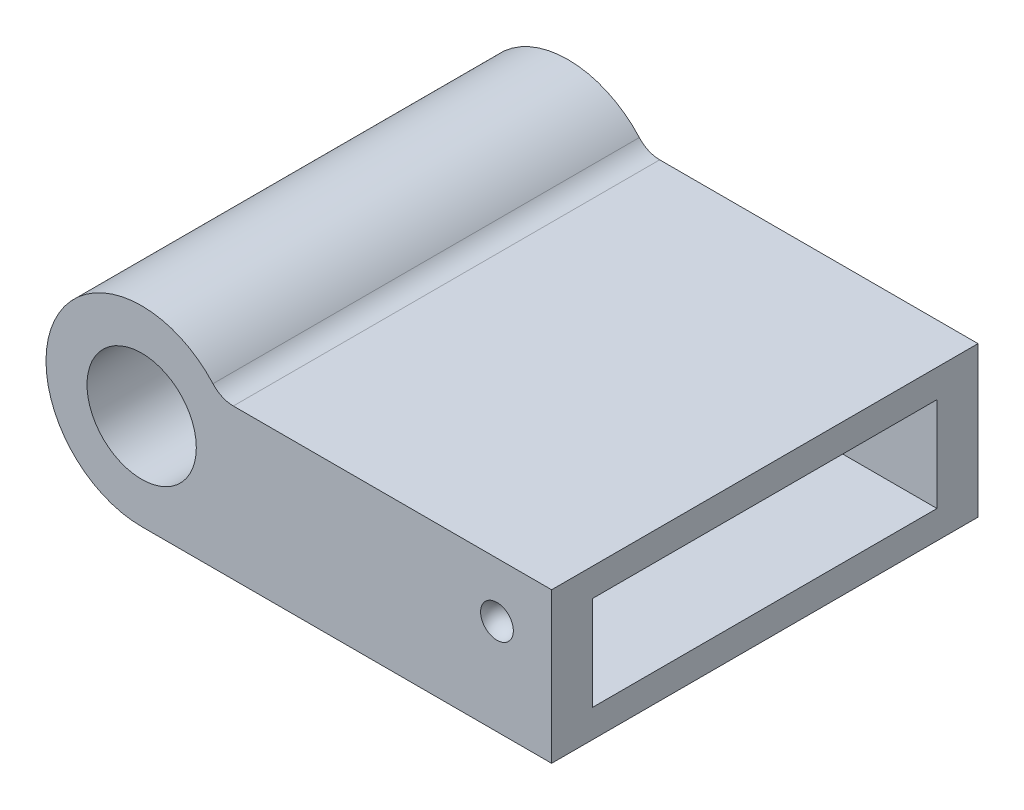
ISO-10303-21;
HEADER;
FILE_DESCRIPTION(('STEP AP214'),'2;1');
FILE_NAME('part.step','',(''),(''),'','','');
FILE_SCHEMA(('AUTOMOTIVE_DESIGN { 1 0 10303 214 1 1 1 1 }'));
ENDSEC;
DATA;
#1=APPLICATION_CONTEXT('core data for automotive mechanical design processes');
#2=APPLICATION_PROTOCOL_DEFINITION('international standard','automotive_design',2000,#1);
#3=PRODUCT_CONTEXT('',#1,'mechanical');
#4=PRODUCT('Part','Part','',(#3));
#5=PRODUCT_RELATED_PRODUCT_CATEGORY('part','',(#4));
#6=PRODUCT_DEFINITION_FORMATION('','',#4);
#7=PRODUCT_DEFINITION_CONTEXT('part definition',#1,'design');
#8=PRODUCT_DEFINITION('design','',#6,#7);
#9=PRODUCT_DEFINITION_SHAPE('','',#8);
#10=(LENGTH_UNIT() NAMED_UNIT(*) SI_UNIT(.MILLI.,.METRE.));
#11=(NAMED_UNIT(*) PLANE_ANGLE_UNIT() SI_UNIT($,.RADIAN.));
#12=(NAMED_UNIT(*) SI_UNIT($,.STERADIAN.) SOLID_ANGLE_UNIT());
#13=UNCERTAINTY_MEASURE_WITH_UNIT(LENGTH_MEASURE(1.E-05),#10,'distance_accuracy_value','');
#14=(GEOMETRIC_REPRESENTATION_CONTEXT(3) GLOBAL_UNCERTAINTY_ASSIGNED_CONTEXT((#13)) GLOBAL_UNIT_ASSIGNED_CONTEXT((#10,
#11,#12)) REPRESENTATION_CONTEXT('',''));
#15=CARTESIAN_POINT('',(0.,0.,0.));
#16=DIRECTION('',(0.,0.,1.));
#17=DIRECTION('',(1.,0.,0.));
#18=AXIS2_PLACEMENT_3D('',#15,#16,#17);
#19=CARTESIAN_POINT('',(0.,0.,7.8));
#20=DIRECTION('',(0.,0.,-1.));
#21=DIRECTION('',(-1.,0.,0.));
#22=AXIS2_PLACEMENT_3D('',#19,#20,#21);
#23=CYLINDRICAL_SURFACE('',#22,3.5);
#24=CARTESIAN_POINT('',(0.,0.,7.8));
#25=DIRECTION('',(0.,0.,1.));
#26=DIRECTION('',(1.,0.,0.));
#27=AXIS2_PLACEMENT_3D('',#24,#25,#26);
#28=CIRCLE('',#27,3.5);
#29=CARTESIAN_POINT('',(2.60874597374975,2.33333333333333,7.8));
#30=VERTEX_POINT('',#29);
#31=CARTESIAN_POINT('',(0.,-3.5,7.8));
#32=VERTEX_POINT('',#31);
#33=EDGE_CURVE('E157',#30,#32,#28,.T.);
#34=ORIENTED_EDGE('',*,*,#33,.F.);
#35=DIRECTION('',(0.,0.,-1.));
#36=VECTOR('',#35,1.);
#37=CARTESIAN_POINT('',(2.60874597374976,2.33333333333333,7.8));
#38=LINE('',#37,#36);
#39=CARTESIAN_POINT('',(2.60874597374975,2.33333333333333,-7.8));
#40=VERTEX_POINT('',#39);
#41=EDGE_CURVE('E181',#30,#40,#38,.T.);
#42=ORIENTED_EDGE('',*,*,#41,.T.);
#43=CARTESIAN_POINT('',(0.,0.,-7.8));
#44=DIRECTION('',(0.,0.,1.));
#45=DIRECTION('',(1.,0.,0.));
#46=AXIS2_PLACEMENT_3D('',#43,#44,#45);
#47=CIRCLE('',#46,3.5);
#48=CARTESIAN_POINT('',(0.,-3.5,-7.8));
#49=VERTEX_POINT('',#48);
#50=EDGE_CURVE('E153',#40,#49,#47,.T.);
#51=ORIENTED_EDGE('',*,*,#50,.T.);
#52=DIRECTION('',(0.,0.,-1.));
#53=VECTOR('',#52,1.);
#54=CARTESIAN_POINT('',(0.,-3.5,7.8));
#55=LINE('',#54,#53);
#56=EDGE_CURVE('E178',#32,#49,#55,.T.);
#57=ORIENTED_EDGE('',*,*,#56,.F.);
#58=EDGE_LOOP('',(#34,#42,#51,#57));
#59=FACE_BOUND('',#58,.T.);
#60=ADVANCED_FACE('F39',(#59),#23,.T.);
#61=CARTESIAN_POINT('',(15.,-3.5,7.8));
#62=DIRECTION('',(0.,1.,0.));
#63=DIRECTION('',(-1.,0.,0.));
#64=AXIS2_PLACEMENT_3D('',#61,#62,#63);
#65=PLANE('',#64);
#66=DIRECTION('',(1.,0.,0.));
#67=VECTOR('',#66,1.);
#68=CARTESIAN_POINT('',(15.,-3.5,-7.8));
#69=LINE('',#68,#67);
#70=CARTESIAN_POINT('',(15.,-3.5,-7.8));
#71=VERTEX_POINT('',#70);
#72=EDGE_CURVE('E168',#49,#71,#69,.T.);
#73=ORIENTED_EDGE('',*,*,#72,.T.);
#74=DIRECTION('',(0.,0.,-1.));
#75=VECTOR('',#74,1.);
#76=CARTESIAN_POINT('',(15.,-3.5,7.8));
#77=LINE('',#76,#75);
#78=CARTESIAN_POINT('',(15.,-3.5,7.8));
#79=VERTEX_POINT('',#78);
#80=EDGE_CURVE('E175',#79,#71,#77,.T.);
#81=ORIENTED_EDGE('',*,*,#80,.F.);
#82=DIRECTION('',(1.,0.,0.));
#83=VECTOR('',#82,1.);
#84=CARTESIAN_POINT('',(15.,-3.5,7.8));
#85=LINE('',#84,#83);
#86=EDGE_CURVE('E159',#32,#79,#85,.T.);
#87=ORIENTED_EDGE('',*,*,#86,.F.);
#88=ORIENTED_EDGE('',*,*,#56,.T.);
#89=EDGE_LOOP('',(#73,#81,#87,#88));
#90=FACE_BOUND('',#89,.T.);
#91=ADVANCED_FACE('F219',(#90),#65,.F.);
#92=CARTESIAN_POINT('',(15.,2.,7.8));
#93=DIRECTION('',(-1.,0.,0.));
#94=DIRECTION('',(0.,-1.,0.));
#95=AXIS2_PLACEMENT_3D('',#92,#93,#94);
#96=PLANE('',#95);
#97=DIRECTION('',(0.,0.,1.));
#98=VECTOR('',#97,1.);
#99=CARTESIAN_POINT('',(15.,0.974999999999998,6.3));
#100=LINE('',#99,#98);
#101=CARTESIAN_POINT('',(15.,0.974999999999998,-6.3));
#102=VERTEX_POINT('',#101);
#103=CARTESIAN_POINT('',(15.,0.974999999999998,6.3));
#104=VERTEX_POINT('',#103);
#105=EDGE_CURVE('E147',#102,#104,#100,.T.);
#106=ORIENTED_EDGE('',*,*,#105,.F.);
#107=DIRECTION('',(0.,1.,0.));
#108=VECTOR('',#107,1.);
#109=CARTESIAN_POINT('',(15.,-2.475,-6.3));
#110=LINE('',#109,#108);
#111=CARTESIAN_POINT('',(15.,-2.475,-6.3));
#112=VERTEX_POINT('',#111);
#113=EDGE_CURVE('E119',#112,#102,#110,.T.);
#114=ORIENTED_EDGE('',*,*,#113,.F.);
#115=DIRECTION('',(0.,0.,-1.));
#116=VECTOR('',#115,1.);
#117=CARTESIAN_POINT('',(15.,-2.475,6.3));
#118=LINE('',#117,#116);
#119=CARTESIAN_POINT('',(15.,-2.475,6.3));
#120=VERTEX_POINT('',#119);
#121=EDGE_CURVE('E136',#120,#112,#118,.T.);
#122=ORIENTED_EDGE('',*,*,#121,.F.);
#123=DIRECTION('',(0.,-1.,0.));
#124=VECTOR('',#123,1.);
#125=CARTESIAN_POINT('',(15.,-2.475,6.3));
#126=LINE('',#125,#124);
#127=EDGE_CURVE('E139',#104,#120,#126,.T.);
#128=ORIENTED_EDGE('',*,*,#127,.F.);
#129=EDGE_LOOP('',(#106,#114,#122,#128));
#130=FACE_BOUND('',#129,.T.);
#131=DIRECTION('',(0.,1.,0.));
#132=VECTOR('',#131,1.);
#133=CARTESIAN_POINT('',(15.,2.,-7.8));
#134=LINE('',#133,#132);
#135=CARTESIAN_POINT('',(15.,2.,-7.8));
#136=VERTEX_POINT('',#135);
#137=EDGE_CURVE('E170',#71,#136,#134,.T.);
#138=ORIENTED_EDGE('',*,*,#137,.T.);
#139=DIRECTION('',(0.,0.,-1.));
#140=VECTOR('',#139,1.);
#141=CARTESIAN_POINT('',(15.,2.,7.8));
#142=LINE('',#141,#140);
#143=CARTESIAN_POINT('',(15.,2.,7.8));
#144=VERTEX_POINT('',#143);
#145=EDGE_CURVE('E166',#144,#136,#142,.T.);
#146=ORIENTED_EDGE('',*,*,#145,.F.);
#147=DIRECTION('',(0.,1.,0.));
#148=VECTOR('',#147,1.);
#149=CARTESIAN_POINT('',(15.,2.,7.8));
#150=LINE('',#149,#148);
#151=EDGE_CURVE('E162',#79,#144,#150,.T.);
#152=ORIENTED_EDGE('',*,*,#151,.F.);
#153=ORIENTED_EDGE('',*,*,#80,.T.);
#154=EDGE_LOOP('',(#138,#146,#152,#153));
#155=FACE_BOUND('',#154,.T.);
#156=ADVANCED_FACE('F221',(#130,#155),#96,.F.);
#157=CARTESIAN_POINT('',(2.87228132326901,2.,7.8));
#158=DIRECTION('',(0.,-1.,0.));
#159=DIRECTION('',(0.,0.,-1.));
#160=AXIS2_PLACEMENT_3D('',#157,#158,#159);
#161=PLANE('',#160);
#162=DIRECTION('',(-1.,0.,0.));
#163=VECTOR('',#162,1.);
#164=CARTESIAN_POINT('',(2.87228132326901,2.,-7.8));
#165=LINE('',#164,#163);
#166=CARTESIAN_POINT('',(3.35410196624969,2.,-7.8));
#167=VERTEX_POINT('',#166);
#168=EDGE_CURVE('E160',#136,#167,#165,.T.);
#169=ORIENTED_EDGE('',*,*,#168,.T.);
#170=DIRECTION('',(0.,0.,1.));
#171=VECTOR('',#170,1.);
#172=CARTESIAN_POINT('',(3.35410196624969,2.,7.8));
#173=LINE('',#172,#171);
#174=CARTESIAN_POINT('',(3.35410196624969,2.,7.8));
#175=VERTEX_POINT('',#174);
#176=EDGE_CURVE('E56',#167,#175,#173,.T.);
#177=ORIENTED_EDGE('',*,*,#176,.T.);
#178=DIRECTION('',(-1.,0.,0.));
#179=VECTOR('',#178,1.);
#180=CARTESIAN_POINT('',(2.87228132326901,2.,7.8));
#181=LINE('',#180,#179);
#182=EDGE_CURVE('E164',#144,#175,#181,.T.);
#183=ORIENTED_EDGE('',*,*,#182,.F.);
#184=ORIENTED_EDGE('',*,*,#145,.T.);
#185=EDGE_LOOP('',(#169,#177,#183,#184));
#186=FACE_BOUND('',#185,.T.);
#187=ADVANCED_FACE('F201',(#186),#161,.F.);
#188=CARTESIAN_POINT('',(0.,0.,7.8));
#189=DIRECTION('',(0.,0.,1.));
#190=DIRECTION('',(1.,0.,0.));
#191=AXIS2_PLACEMENT_3D('',#188,#189,#190);
#192=PLANE('',#191);
#193=CARTESIAN_POINT('',(13.,0.,7.8));
#194=DIRECTION('',(0.,0.,1.));
#195=DIRECTION('',(1.,0.,0.));
#196=AXIS2_PLACEMENT_3D('',#193,#194,#195);
#197=CIRCLE('',#196,0.599591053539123);
#198=CARTESIAN_POINT('',(13.5995910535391,0.,7.8));
#199=VERTEX_POINT('',#198);
#200=EDGE_CURVE('E43',#199,#199,#197,.T.);
#201=ORIENTED_EDGE('',*,*,#200,.F.);
#202=EDGE_LOOP('',(#201));
#203=FACE_BOUND('',#202,.T.);
#204=CARTESIAN_POINT('',(0.,0.,7.8));
#205=DIRECTION('',(0.,0.,1.));
#206=DIRECTION('',(1.,0.,0.));
#207=AXIS2_PLACEMENT_3D('',#204,#205,#206);
#208=CIRCLE('',#207,2.);
#209=CARTESIAN_POINT('',(2.,0.,7.8));
#210=VERTEX_POINT('',#209);
#211=EDGE_CURVE('E142',#210,#210,#208,.T.);
#212=ORIENTED_EDGE('',*,*,#211,.F.);
#213=EDGE_LOOP('',(#212));
#214=FACE_BOUND('',#213,.T.);
#215=ORIENTED_EDGE('',*,*,#182,.T.);
#216=CARTESIAN_POINT('',(3.35410196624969,3.,7.8));
#217=DIRECTION('',(0.,0.,1.));
#218=DIRECTION('',(1.,0.,0.));
#219=AXIS2_PLACEMENT_3D('',#216,#217,#218);
#220=CIRCLE('',#219,1.);
#221=EDGE_CURVE('E11',#175,#30,#220,.F.);
#222=ORIENTED_EDGE('',*,*,#221,.T.);
#223=ORIENTED_EDGE('',*,*,#33,.T.);
#224=ORIENTED_EDGE('',*,*,#86,.T.);
#225=ORIENTED_EDGE('',*,*,#151,.T.);
#226=EDGE_LOOP('',(#215,#222,#223,#224,#225));
#227=FACE_BOUND('',#226,.T.);
#228=ADVANCED_FACE('F197',(#203,#214,#227),#192,.T.);
#229=CARTESIAN_POINT('',(0.,0.,-7.8));
#230=DIRECTION('',(0.,0.,1.));
#231=DIRECTION('',(1.,0.,0.));
#232=AXIS2_PLACEMENT_3D('',#229,#230,#231);
#233=PLANE('',#232);
#234=CARTESIAN_POINT('',(13.,0.,-7.8));
#235=DIRECTION('',(0.,0.,1.));
#236=DIRECTION('',(1.,0.,0.));
#237=AXIS2_PLACEMENT_3D('',#234,#235,#236);
#238=CIRCLE('',#237,0.599591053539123);
#239=CARTESIAN_POINT('',(13.5995910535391,0.,-7.8));
#240=VERTEX_POINT('',#239);
#241=EDGE_CURVE('E185',#240,#240,#238,.T.);
#242=ORIENTED_EDGE('',*,*,#241,.T.);
#243=EDGE_LOOP('',(#242));
#244=FACE_BOUND('',#243,.T.);
#245=CARTESIAN_POINT('',(0.,0.,-7.8));
#246=DIRECTION('',(0.,0.,1.));
#247=DIRECTION('',(1.,0.,0.));
#248=AXIS2_PLACEMENT_3D('',#245,#246,#247);
#249=CIRCLE('',#248,2.);
#250=CARTESIAN_POINT('',(2.,0.,-7.8));
#251=VERTEX_POINT('',#250);
#252=EDGE_CURVE('E182',#251,#251,#249,.T.);
#253=ORIENTED_EDGE('',*,*,#252,.T.);
#254=EDGE_LOOP('',(#253));
#255=FACE_BOUND('',#254,.T.);
#256=ORIENTED_EDGE('',*,*,#50,.F.);
#257=CARTESIAN_POINT('',(3.35410196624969,3.,-7.8));
#258=DIRECTION('',(0.,0.,1.));
#259=DIRECTION('',(1.,0.,0.));
#260=AXIS2_PLACEMENT_3D('',#257,#258,#259);
#261=CIRCLE('',#260,1.);
#262=EDGE_CURVE('E48',#40,#167,#261,.T.);
#263=ORIENTED_EDGE('',*,*,#262,.T.);
#264=ORIENTED_EDGE('',*,*,#168,.F.);
#265=ORIENTED_EDGE('',*,*,#137,.F.);
#266=ORIENTED_EDGE('',*,*,#72,.F.);
#267=EDGE_LOOP('',(#256,#263,#264,#265,#266));
#268=FACE_BOUND('',#267,.T.);
#269=ADVANCED_FACE('F200',(#244,#255,#268),#233,.F.);
#270=CARTESIAN_POINT('',(6.4,-2.475,-6.3));
#271=DIRECTION('',(0.,0.,-1.));
#272=DIRECTION('',(-1.,0.,0.));
#273=AXIS2_PLACEMENT_3D('',#270,#271,#272);
#274=PLANE('',#273);
#275=ORIENTED_EDGE('',*,*,#113,.T.);
#276=DIRECTION('',(1.,0.,0.));
#277=VECTOR('',#276,1.);
#278=CARTESIAN_POINT('',(6.4,0.975000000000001,-6.3));
#279=LINE('',#278,#277);
#280=CARTESIAN_POINT('',(6.4,0.975000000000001,-6.3));
#281=VERTEX_POINT('',#280);
#282=EDGE_CURVE('E112',#281,#102,#279,.T.);
#283=ORIENTED_EDGE('',*,*,#282,.F.);
#284=DIRECTION('',(0.,1.,0.));
#285=VECTOR('',#284,1.);
#286=CARTESIAN_POINT('',(6.4,-2.475,-6.3));
#287=LINE('',#286,#285);
#288=CARTESIAN_POINT('',(6.4,-2.475,-6.3));
#289=VERTEX_POINT('',#288);
#290=EDGE_CURVE('E116',#289,#281,#287,.T.);
#291=ORIENTED_EDGE('',*,*,#290,.F.);
#292=DIRECTION('',(1.,0.,0.));
#293=VECTOR('',#292,1.);
#294=CARTESIAN_POINT('',(6.4,-2.475,-6.3));
#295=LINE('',#294,#293);
#296=EDGE_CURVE('E151',#289,#112,#295,.T.);
#297=ORIENTED_EDGE('',*,*,#296,.T.);
#298=EDGE_LOOP('',(#275,#283,#291,#297));
#299=FACE_BOUND('',#298,.T.);
#300=ADVANCED_FACE('F114',(#299),#274,.F.);
#301=CARTESIAN_POINT('',(6.4,-2.475,6.3));
#302=DIRECTION('',(0.,-1.,0.));
#303=DIRECTION('',(1.,0.,0.));
#304=AXIS2_PLACEMENT_3D('',#301,#302,#303);
#305=PLANE('',#304);
#306=ORIENTED_EDGE('',*,*,#121,.T.);
#307=ORIENTED_EDGE('',*,*,#296,.F.);
#308=DIRECTION('',(0.,0.,-1.));
#309=VECTOR('',#308,1.);
#310=CARTESIAN_POINT('',(6.4,-2.475,6.3));
#311=LINE('',#310,#309);
#312=CARTESIAN_POINT('',(6.4,-2.475,6.3));
#313=VERTEX_POINT('',#312);
#314=EDGE_CURVE('E124',#313,#289,#311,.T.);
#315=ORIENTED_EDGE('',*,*,#314,.F.);
#316=DIRECTION('',(1.,0.,0.));
#317=VECTOR('',#316,1.);
#318=CARTESIAN_POINT('',(6.4,-2.475,6.3));
#319=LINE('',#318,#317);
#320=EDGE_CURVE('E154',#313,#120,#319,.T.);
#321=ORIENTED_EDGE('',*,*,#320,.T.);
#322=EDGE_LOOP('',(#306,#307,#315,#321));
#323=FACE_BOUND('',#322,.T.);
#324=ADVANCED_FACE('F251',(#323),#305,.F.);
#325=CARTESIAN_POINT('',(6.4,-2.475,6.3));
#326=DIRECTION('',(0.,0.,1.));
#327=DIRECTION('',(1.,0.,0.));
#328=AXIS2_PLACEMENT_3D('',#325,#326,#327);
#329=PLANE('',#328);
#330=ORIENTED_EDGE('',*,*,#127,.T.);
#331=ORIENTED_EDGE('',*,*,#320,.F.);
#332=DIRECTION('',(0.,-1.,0.));
#333=VECTOR('',#332,1.);
#334=CARTESIAN_POINT('',(6.4,-2.475,6.3));
#335=LINE('',#334,#333);
#336=CARTESIAN_POINT('',(6.4,0.975000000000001,6.3));
#337=VERTEX_POINT('',#336);
#338=EDGE_CURVE('E132',#337,#313,#335,.T.);
#339=ORIENTED_EDGE('',*,*,#338,.F.);
#340=DIRECTION('',(1.,0.,0.));
#341=VECTOR('',#340,1.);
#342=CARTESIAN_POINT('',(6.4,0.975000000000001,6.3));
#343=LINE('',#342,#341);
#344=EDGE_CURVE('E123',#337,#104,#343,.T.);
#345=ORIENTED_EDGE('',*,*,#344,.T.);
#346=EDGE_LOOP('',(#330,#331,#339,#345));
#347=FACE_BOUND('',#346,.T.);
#348=ADVANCED_FACE('F262',(#347),#329,.F.);
#349=CARTESIAN_POINT('',(6.4,0.975000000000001,6.3));
#350=DIRECTION('',(0.,1.,0.));
#351=DIRECTION('',(-1.,0.,0.));
#352=AXIS2_PLACEMENT_3D('',#349,#350,#351);
#353=PLANE('',#352);
#354=ORIENTED_EDGE('',*,*,#105,.T.);
#355=ORIENTED_EDGE('',*,*,#344,.F.);
#356=DIRECTION('',(0.,0.,1.));
#357=VECTOR('',#356,1.);
#358=CARTESIAN_POINT('',(6.4,0.975000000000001,6.3));
#359=LINE('',#358,#357);
#360=EDGE_CURVE('E127',#281,#337,#359,.T.);
#361=ORIENTED_EDGE('',*,*,#360,.F.);
#362=ORIENTED_EDGE('',*,*,#282,.T.);
#363=EDGE_LOOP('',(#354,#355,#361,#362));
#364=FACE_BOUND('',#363,.T.);
#365=ADVANCED_FACE('F128',(#364),#353,.F.);
#366=CARTESIAN_POINT('',(6.4,0.,0.));
#367=DIRECTION('',(-1.,0.,0.));
#368=DIRECTION('',(0.,0.,1.));
#369=AXIS2_PLACEMENT_3D('',#366,#367,#368);
#370=PLANE('',#369);
#371=ORIENTED_EDGE('',*,*,#290,.T.);
#372=ORIENTED_EDGE('',*,*,#360,.T.);
#373=ORIENTED_EDGE('',*,*,#338,.T.);
#374=ORIENTED_EDGE('',*,*,#314,.T.);
#375=EDGE_LOOP('',(#371,#372,#373,#374));
#376=FACE_BOUND('',#375,.T.);
#377=ADVANCED_FACE('F134',(#376),#370,.F.);
#378=CARTESIAN_POINT('',(0.,0.,-10.));
#379=DIRECTION('',(0.,0.,1.));
#380=DIRECTION('',(1.,0.,0.));
#381=AXIS2_PLACEMENT_3D('',#378,#379,#380);
#382=CYLINDRICAL_SURFACE('',#381,2.);
#383=ORIENTED_EDGE('',*,*,#211,.T.);
#384=EDGE_LOOP('',(#383));
#385=FACE_BOUND('',#384,.T.);
#386=ORIENTED_EDGE('',*,*,#252,.F.);
#387=EDGE_LOOP('',(#386));
#388=FACE_BOUND('',#387,.T.);
#389=ADVANCED_FACE('F289',(#385,#388),#382,.F.);
#390=CARTESIAN_POINT('',(3.35410196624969,3.,7.8));
#391=DIRECTION('',(0.,0.,-1.));
#392=DIRECTION('',(-1.,0.,0.));
#393=AXIS2_PLACEMENT_3D('',#390,#391,#392);
#394=CYLINDRICAL_SURFACE('',#393,1.);
#395=ORIENTED_EDGE('',*,*,#221,.F.);
#396=ORIENTED_EDGE('',*,*,#176,.F.);
#397=ORIENTED_EDGE('',*,*,#262,.F.);
#398=ORIENTED_EDGE('',*,*,#41,.F.);
#399=EDGE_LOOP('',(#395,#396,#397,#398));
#400=FACE_BOUND('',#399,.T.);
#401=ADVANCED_FACE('F41',(#400),#394,.F.);
#402=CARTESIAN_POINT('',(13.,0.,-7.82214878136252));
#403=DIRECTION('',(0.,0.,-1.));
#404=DIRECTION('',(1.,0.,0.));
#405=AXIS2_PLACEMENT_3D('',#402,#403,#404);
#406=SPHERICAL_SURFACE('',#405,0.6);
#407=ORIENTED_EDGE('',*,*,#241,.F.);
#408=EDGE_LOOP('',(#407));
#409=FACE_BOUND('',#408,.T.);
#410=ADVANCED_FACE('F315',(#409),#406,.F.);
#411=CARTESIAN_POINT('',(13.,0.,7.82214878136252));
#412=DIRECTION('',(0.,0.,-1.));
#413=DIRECTION('',(1.,0.,0.));
#414=AXIS2_PLACEMENT_3D('',#411,#412,#413);
#415=SPHERICAL_SURFACE('',#414,0.6);
#416=ORIENTED_EDGE('',*,*,#200,.T.);
#417=EDGE_LOOP('',(#416));
#418=FACE_BOUND('',#417,.T.);
#419=ADVANCED_FACE('F195',(#418),#415,.F.);
#420=CLOSED_SHELL('',(#60,#91,#156,#187,#228,#269,#300,#324,#348,#365,#377,#389,#401,#410,#419));
#421=MANIFOLD_SOLID_BREP('B2',#420);
#422=ADVANCED_BREP_SHAPE_REPRESENTATION('',(#18,#421),#14);
#423=SHAPE_DEFINITION_REPRESENTATION(#9,#422);
ENDSEC;
END-ISO-10303-21;
